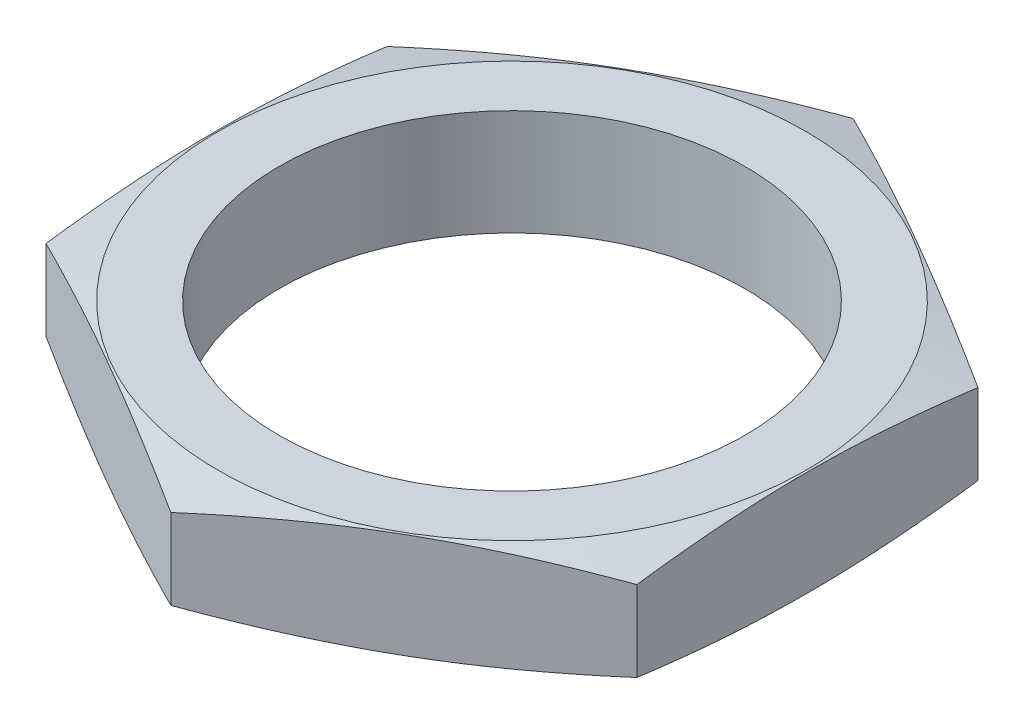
ISO-10303-21;
HEADER;
FILE_DESCRIPTION(('STEP AP214'),'2;1');
FILE_NAME('part.step','',(''),(''),'','','');
FILE_SCHEMA(('AUTOMOTIVE_DESIGN { 1 0 10303 214 1 1 1 1 }'));
ENDSEC;
DATA;
#1=APPLICATION_CONTEXT('core data for automotive mechanical design processes');
#2=APPLICATION_PROTOCOL_DEFINITION('international standard','automotive_design',2000,#1);
#3=PRODUCT_CONTEXT('',#1,'mechanical');
#4=PRODUCT('Part','Part','',(#3));
#5=PRODUCT_RELATED_PRODUCT_CATEGORY('part','',(#4));
#6=PRODUCT_DEFINITION_FORMATION('','',#4);
#7=PRODUCT_DEFINITION_CONTEXT('part definition',#1,'design');
#8=PRODUCT_DEFINITION('design','',#6,#7);
#9=PRODUCT_DEFINITION_SHAPE('','',#8);
#10=(LENGTH_UNIT() NAMED_UNIT(*) SI_UNIT(.MILLI.,.METRE.));
#11=(NAMED_UNIT(*) PLANE_ANGLE_UNIT() SI_UNIT($,.RADIAN.));
#12=(NAMED_UNIT(*) SI_UNIT($,.STERADIAN.) SOLID_ANGLE_UNIT());
#13=UNCERTAINTY_MEASURE_WITH_UNIT(LENGTH_MEASURE(1.E-05),#10,'distance_accuracy_value','');
#14=(GEOMETRIC_REPRESENTATION_CONTEXT(3) GLOBAL_UNCERTAINTY_ASSIGNED_CONTEXT((#13)) GLOBAL_UNIT_ASSIGNED_CONTEXT((#10,
#11,#12)) REPRESENTATION_CONTEXT('',''));
#15=CARTESIAN_POINT('',(0.,0.,0.));
#16=DIRECTION('',(0.,0.,1.));
#17=DIRECTION('',(1.,0.,0.));
#18=AXIS2_PLACEMENT_3D('',#15,#16,#17);
#19=CARTESIAN_POINT('',(-6.975,2.5,-4.02701812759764));
#20=DIRECTION('',(1.,0.,0.));
#21=DIRECTION('',(0.,0.,-1.));
#22=AXIS2_PLACEMENT_3D('',#19,#20,#21);
#23=PLANE('',#22);
#24=CARTESIAN_POINT('',(-6.97499999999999,1.55225197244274,-10.6460668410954));
#25=CARTESIAN_POINT('',(-6.975,1.48136600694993,-10.3297089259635));
#26=CARTESIAN_POINT('',(-6.975,1.41134813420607,-10.0131529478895));
#27=CARTESIAN_POINT('',(-6.975,1.27351713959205,-9.3795476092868));
#28=CARTESIAN_POINT('',(-6.975,1.20570411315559,-9.06249822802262));
#29=CARTESIAN_POINT('',(-6.975,1.0726921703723,-8.42752387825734));
#30=CARTESIAN_POINT('',(-6.975,1.007495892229,-8.10959835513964));
#31=CARTESIAN_POINT('',(-6.975,0.880422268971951,-7.47308507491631));
#32=CARTESIAN_POINT('',(-6.975,0.818544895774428,-7.15449732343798));
#33=CARTESIAN_POINT('',(-6.975,0.69937662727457,-6.51908795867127));
#34=CARTESIAN_POINT('',(-6.975,0.642053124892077,-6.20227249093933));
#35=CARTESIAN_POINT('',(-6.975,0.532418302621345,-5.56777699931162));
#36=CARTESIAN_POINT('',(-6.975,0.480106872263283,-5.25009699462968));
#37=CARTESIAN_POINT('',(-6.975,0.381675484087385,-4.61381156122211));
#38=CARTESIAN_POINT('',(-6.975,0.335554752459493,-4.29520625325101));
#39=CARTESIAN_POINT('',(-6.975,0.250865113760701,-3.65698200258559));
#40=CARTESIAN_POINT('',(-6.975,0.212296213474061,-3.33736305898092));
#41=CARTESIAN_POINT('',(-6.975,0.14380384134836,-2.69350835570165));
#42=CARTESIAN_POINT('',(-6.975,0.113983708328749,-2.36926143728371));
#43=CARTESIAN_POINT('',(-6.975,0.0650469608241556,-1.71995393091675));
#44=CARTESIAN_POINT('',(-6.975,0.0459301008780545,-1.39489336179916));
#45=CARTESIAN_POINT('',(-6.975,0.019514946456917,-0.744429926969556));
#46=CARTESIAN_POINT('',(-6.975,0.0122113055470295,-0.419027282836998));
#47=CARTESIAN_POINT('',(-6.975,0.00987146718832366,0.231822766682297));
#48=CARTESIAN_POINT('',(-6.975,0.0148352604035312,0.557270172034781));
#49=CARTESIAN_POINT('',(-6.975,0.0367511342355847,1.20893749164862));
#50=CARTESIAN_POINT('',(-6.975,0.0537467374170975,1.53515591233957));
#51=CARTESIAN_POINT('',(-6.975,0.0987567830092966,2.18682465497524));
#52=CARTESIAN_POINT('',(-6.975,0.126771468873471,2.51227495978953));
#53=CARTESIAN_POINT('',(-6.975,0.192406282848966,3.16240495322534));
#54=CARTESIAN_POINT('',(-6.975,0.230032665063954,3.48708400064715));
#55=CARTESIAN_POINT('',(-6.975,0.313327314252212,4.13539745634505));
#56=CARTESIAN_POINT('',(-6.975,0.358995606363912,4.45903186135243));
#57=CARTESIAN_POINT('',(-6.975,0.453637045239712,5.08365433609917));
#58=CARTESIAN_POINT('',(-6.975,0.502184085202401,5.38470762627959));
#59=CARTESIAN_POINT('',(-6.975,0.603982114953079,5.98602171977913));
#60=CARTESIAN_POINT('',(-6.975,0.657233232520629,6.28628250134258));
#61=CARTESIAN_POINT('',(-6.975,0.767579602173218,6.88612116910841));
#62=CARTESIAN_POINT('',(-6.975,0.824675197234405,7.18569899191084));
#63=CARTESIAN_POINT('',(-6.975,0.942009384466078,7.78423999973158));
#64=CARTESIAN_POINT('',(-6.975,1.00224801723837,8.08320317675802));
#65=CARTESIAN_POINT('',(-6.975,1.18682528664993,8.979434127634));
#66=CARTESIAN_POINT('',(-6.975,1.3150003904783,9.57591097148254));
#67=CARTESIAN_POINT('',(-6.975,1.57828674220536,10.7672794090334));
#68=CARTESIAN_POINT('',(-6.975,1.7133975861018,11.3621710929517));
#69=CARTESIAN_POINT('',(-6.975,1.98715444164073,12.5449761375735));
#70=CARTESIAN_POINT('',(-6.975,2.12575262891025,13.1329005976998));
#71=CARTESIAN_POINT('',(-6.975,2.40641957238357,14.3079292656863));
#72=CARTESIAN_POINT('',(-6.975,2.54848839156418,14.8950334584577));
#73=CARTESIAN_POINT('',(-6.975,2.8350145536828,16.067892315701));
#74=CARTESIAN_POINT('',(-6.975,2.97946874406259,16.6536477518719));
#75=CARTESIAN_POINT('',(-6.975,3.27035075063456,17.8246482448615));
#76=CARTESIAN_POINT('',(-6.975,3.41677850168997,18.4098933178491));
#77=CARTESIAN_POINT('',(-6.975,3.5639053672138,18.99496044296));
#78=B_SPLINE_CURVE_WITH_KNOTS('',3,(#24,#25,#26,#27,#28,#29,#30,#31,#32,#33,#34,#35,#36,#37,#38,
#39,#40,#41,#42,#43,#44,#45,#46,#47,#48,#49,#50,#51,#52,#53,#54,#55,#56,#57,#58,#59,#60,#61,#62,
#63,#64,#65,#66,#67,#68,#69,#70,#71,#72,#73,#74,#75,#76,#77),.UNSPECIFIED.,.F.,.F.,(4,2,2,2,2,2,
2,2,2,2,2,2,2,2,2,2,2,2,2,2,2,2,2,2,2,2,4),(0.,0.972610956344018,1.94526395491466,
2.91887413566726,3.89247607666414,4.85832291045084,5.8241484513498,6.78985315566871,
7.75555872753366,8.73224987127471,9.70891861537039,10.6851452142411,11.6613710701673,
12.64114638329,13.6209433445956,14.6013794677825,15.5818186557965,16.4966020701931,
17.4114103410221,18.3263003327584,19.2412021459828,21.0714097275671,22.9015108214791,
24.7136166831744,26.5257554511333,28.3356654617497,30.1455158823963),.UNSPECIFIED.);
#79=CARTESIAN_POINT('',(-6.975,0.3,4.02701812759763));
#80=VERTEX_POINT('',#79);
#81=CARTESIAN_POINT('',(-6.975,0.3,-4.02701812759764));
#82=VERTEX_POINT('',#81);
#83=EDGE_CURVE('E50',#80,#82,#78,.F.);
#84=ORIENTED_EDGE('',*,*,#83,.F.);
#85=DIRECTION('',(0.,-1.,0.));
#86=VECTOR('',#85,1.);
#87=CARTESIAN_POINT('',(-6.975,2.5,4.02701812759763));
#88=LINE('',#87,#86);
#89=CARTESIAN_POINT('',(-6.975,2.2,4.02701812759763));
#90=VERTEX_POINT('',#89);
#91=EDGE_CURVE('E11',#90,#80,#88,.T.);
#92=ORIENTED_EDGE('',*,*,#91,.F.);
#93=CARTESIAN_POINT('',(-6.97499999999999,0.947748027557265,-10.6460668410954));
#94=CARTESIAN_POINT('',(-6.975,1.01863399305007,-10.3297089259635));
#95=CARTESIAN_POINT('',(-6.975,1.08865186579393,-10.0131529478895));
#96=CARTESIAN_POINT('',(-6.975,1.22648286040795,-9.3795476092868));
#97=CARTESIAN_POINT('',(-6.975,1.29429588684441,-9.06249822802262));
#98=CARTESIAN_POINT('',(-6.975,1.4273078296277,-8.42752387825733));
#99=CARTESIAN_POINT('',(-6.975,1.492504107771,-8.10959835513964));
#100=CARTESIAN_POINT('',(-6.975,1.61957773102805,-7.47308507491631));
#101=CARTESIAN_POINT('',(-6.975,1.68145510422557,-7.15449732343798));
#102=CARTESIAN_POINT('',(-6.975,1.80062337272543,-6.51908795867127));
#103=CARTESIAN_POINT('',(-6.975,1.85794687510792,-6.20227249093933));
#104=CARTESIAN_POINT('',(-6.975,1.96758169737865,-5.56777699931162));
#105=CARTESIAN_POINT('',(-6.975,2.01989312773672,-5.25009699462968));
#106=CARTESIAN_POINT('',(-6.975,2.11832451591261,-4.61381156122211));
#107=CARTESIAN_POINT('',(-6.975,2.16444524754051,-4.29520625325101));
#108=CARTESIAN_POINT('',(-6.975,2.2491348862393,-3.65698200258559));
#109=CARTESIAN_POINT('',(-6.975,2.28770378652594,-3.33736305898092));
#110=CARTESIAN_POINT('',(-6.975,2.35619615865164,-2.69350835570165));
#111=CARTESIAN_POINT('',(-6.975,2.38601629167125,-2.36926143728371));
#112=CARTESIAN_POINT('',(-6.975,2.43495303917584,-1.71995393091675));
#113=CARTESIAN_POINT('',(-6.975,2.45406989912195,-1.39489336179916));
#114=CARTESIAN_POINT('',(-6.975,2.48048505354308,-0.744429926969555));
#115=CARTESIAN_POINT('',(-6.975,2.48778869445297,-0.419027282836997));
#116=CARTESIAN_POINT('',(-6.975,2.49012853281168,0.231822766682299));
#117=CARTESIAN_POINT('',(-6.975,2.48516473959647,0.557270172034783));
#118=CARTESIAN_POINT('',(-6.975,2.46324886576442,1.20893749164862));
#119=CARTESIAN_POINT('',(-6.975,2.4462532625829,1.53515591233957));
#120=CARTESIAN_POINT('',(-6.975,2.4012432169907,2.18682465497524));
#121=CARTESIAN_POINT('',(-6.975,2.37322853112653,2.51227495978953));
#122=CARTESIAN_POINT('',(-6.975,2.30759371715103,3.16240495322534));
#123=CARTESIAN_POINT('',(-6.975,2.26996733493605,3.48708400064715));
#124=CARTESIAN_POINT('',(-6.975,2.18667268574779,4.13539745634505));
#125=CARTESIAN_POINT('',(-6.975,2.14100439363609,4.45903186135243));
#126=CARTESIAN_POINT('',(-6.975,2.04636295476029,5.08365433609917));
#127=CARTESIAN_POINT('',(-6.975,1.9978159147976,5.38470762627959));
#128=CARTESIAN_POINT('',(-6.975,1.89601788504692,5.98602171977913));
#129=CARTESIAN_POINT('',(-6.975,1.84276676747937,6.28628250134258));
#130=CARTESIAN_POINT('',(-6.975,1.73242039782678,6.88612116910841));
#131=CARTESIAN_POINT('',(-6.975,1.6753248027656,7.18569899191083));
#132=CARTESIAN_POINT('',(-6.975,1.55799061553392,7.78423999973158));
#133=CARTESIAN_POINT('',(-6.975,1.49775198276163,8.08320317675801));
#134=CARTESIAN_POINT('',(-6.975,1.31317471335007,8.979434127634));
#135=CARTESIAN_POINT('',(-6.975,1.1849996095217,9.57591097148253));
#136=CARTESIAN_POINT('',(-6.975,0.921713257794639,10.7672794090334));
#137=CARTESIAN_POINT('',(-6.975,0.786602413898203,11.3621710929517));
#138=CARTESIAN_POINT('',(-6.975,0.512845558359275,12.5449761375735));
#139=CARTESIAN_POINT('',(-6.975,0.37424737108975,13.1329005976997));
#140=CARTESIAN_POINT('',(-6.975,0.0935804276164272,14.3079292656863));
#141=CARTESIAN_POINT('',(-6.975,-0.0484883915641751,14.8950334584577));
#142=CARTESIAN_POINT('',(-6.975,-0.335014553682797,16.067892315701));
#143=CARTESIAN_POINT('',(-6.975,-0.479468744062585,16.6536477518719));
#144=CARTESIAN_POINT('',(-6.975,-0.770350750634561,17.8246482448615));
#145=CARTESIAN_POINT('',(-6.975,-0.916778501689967,18.4098933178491));
#146=CARTESIAN_POINT('',(-6.975,-1.0639053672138,18.99496044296));
#147=B_SPLINE_CURVE_WITH_KNOTS('',3,(#93,#94,#95,#96,#97,#98,#99,#100,#101,#102,#103,#104,#105,
#106,#107,#108,#109,#110,#111,#112,#113,#114,#115,#116,#117,#118,#119,#120,#121,#122,#123,#124,
#125,#126,#127,#128,#129,#130,#131,#132,#133,#134,#135,#136,#137,#138,#139,#140,#141,#142,#143,
#144,#145,#146),.UNSPECIFIED.,.F.,.F.,(4,2,2,2,2,2,2,2,2,2,2,2,2,2,2,2,2,2,2,2,2,2,2,2,2,2,4),
(0.,0.972610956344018,1.94526395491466,2.91887413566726,3.89247607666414,4.85832291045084,
5.8241484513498,6.78985315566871,7.75555872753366,8.73224987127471,9.70891861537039,
10.6851452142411,11.6613710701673,12.64114638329,13.6209433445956,14.6013794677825,
15.5818186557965,16.4966020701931,17.4114103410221,18.3263003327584,19.2412021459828,
21.0714097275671,22.9015108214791,24.7136166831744,26.5257554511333,28.3356654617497,
30.1455158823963),.UNSPECIFIED.);
#148=CARTESIAN_POINT('',(-6.975,2.2,-4.02701812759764));
#149=VERTEX_POINT('',#148);
#150=EDGE_CURVE('E201',#149,#90,#147,.T.);
#151=ORIENTED_EDGE('',*,*,#150,.F.);
#152=DIRECTION('',(0.,-1.,0.));
#153=VECTOR('',#152,1.);
#154=CARTESIAN_POINT('',(-6.975,2.5,-4.02701812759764));
#155=LINE('',#154,#153);
#156=EDGE_CURVE('E107',#149,#82,#155,.T.);
#157=ORIENTED_EDGE('',*,*,#156,.T.);
#158=EDGE_LOOP('',(#84,#92,#151,#157));
#159=FACE_BOUND('',#158,.T.);
#160=ADVANCED_FACE('F35',(#159),#23,.F.);
#161=CARTESIAN_POINT('',(-6.975,2.5,4.02701812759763));
#162=DIRECTION('',(0.500000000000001,0.,-0.866025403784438));
#163=DIRECTION('',(-0.866025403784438,0.,-0.500000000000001));
#164=AXIS2_PLACEMENT_3D('',#161,#162,#163);
#165=PLANE('',#164);
#166=CARTESIAN_POINT('',(0.000199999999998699,0.300030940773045,8.05415172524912));
#167=CARTESIAN_POINT('',(-0.28947080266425,0.255199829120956,7.88691020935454));
#168=CARTESIAN_POINT('',(-0.579666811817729,0.214500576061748,7.71936546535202));
#169=CARTESIAN_POINT('',(-1.16108368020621,0.142995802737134,7.38368427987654));
#170=CARTESIAN_POINT('',(-1.45230490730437,0.11219430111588,7.21554762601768));
#171=CARTESIAN_POINT('',(-2.03400653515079,0.0622832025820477,6.87970203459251));
#172=CARTESIAN_POINT('',(-2.32448300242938,0.0431140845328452,6.71199536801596));
#173=CARTESIAN_POINT('',(-2.90580636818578,0.017410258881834,6.37636816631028));
#174=CARTESIAN_POINT('',(-3.19665318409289,0.0108731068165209,6.20844767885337));
#175=CARTESIAN_POINT('',(-3.77834681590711,0.0108731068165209,5.87260670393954));
#176=CARTESIAN_POINT('',(-4.06919363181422,0.017410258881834,5.70468621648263));
#177=CARTESIAN_POINT('',(-4.65051699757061,0.043114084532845,5.36905901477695));
#178=CARTESIAN_POINT('',(-4.94099346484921,0.0622832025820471,5.2013523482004));
#179=CARTESIAN_POINT('',(-5.52269509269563,0.112194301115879,4.86550675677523));
#180=CARTESIAN_POINT('',(-5.81391631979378,0.142995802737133,4.69737010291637));
#181=CARTESIAN_POINT('',(-6.39533318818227,0.214500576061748,4.36168891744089));
#182=CARTESIAN_POINT('',(-6.68552919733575,0.255199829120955,4.19414417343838));
#183=CARTESIAN_POINT('',(-6.9752,0.300030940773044,4.0269026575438));
#184=B_SPLINE_CURVE_WITH_KNOTS('',3,(#166,#167,#168,#169,#170,#171,#172,#173,#174,#175,#176,
#177,#178,#179,#180,#181,#182,#183),.UNSPECIFIED.,.F.,.F.,(4,2,2,2,2,2,2,2,4),(0.,
1.01247516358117,2.02536089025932,3.03301914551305,4.04048238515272,5.04794562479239,
6.05560388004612,7.06848960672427,8.08096477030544),.UNSPECIFIED.);
#185=CARTESIAN_POINT('',(0.,0.3,8.05403625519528));
#186=VERTEX_POINT('',#185);
#187=EDGE_CURVE('E131',#186,#80,#184,.T.);
#188=ORIENTED_EDGE('',*,*,#187,.F.);
#189=DIRECTION('',(0.,-1.,0.));
#190=VECTOR('',#189,1.);
#191=CARTESIAN_POINT('',(0.,2.5,8.05403625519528));
#192=LINE('',#191,#190);
#193=CARTESIAN_POINT('',(0.,2.2,8.05403625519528));
#194=VERTEX_POINT('',#193);
#195=EDGE_CURVE('E43',#194,#186,#192,.T.);
#196=ORIENTED_EDGE('',*,*,#195,.F.);
#197=CARTESIAN_POINT('',(-6.9752,2.19996905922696,4.0269026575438));
#198=CARTESIAN_POINT('',(-6.68552919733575,2.24480017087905,4.19414417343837));
#199=CARTESIAN_POINT('',(-6.39533318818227,2.28549942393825,4.36168891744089));
#200=CARTESIAN_POINT('',(-5.81391631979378,2.35700419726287,4.69737010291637));
#201=CARTESIAN_POINT('',(-5.52269509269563,2.38780569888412,4.86550675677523));
#202=CARTESIAN_POINT('',(-4.94099346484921,2.43771679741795,5.2013523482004));
#203=CARTESIAN_POINT('',(-4.65051699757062,2.45688591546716,5.36905901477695));
#204=CARTESIAN_POINT('',(-4.06919363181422,2.48258974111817,5.70468621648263));
#205=CARTESIAN_POINT('',(-3.77834681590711,2.48912689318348,5.87260670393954));
#206=CARTESIAN_POINT('',(-3.19665318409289,2.48912689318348,6.20844767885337));
#207=CARTESIAN_POINT('',(-2.90580636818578,2.48258974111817,6.37636816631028));
#208=CARTESIAN_POINT('',(-2.32448300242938,2.45688591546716,6.71199536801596));
#209=CARTESIAN_POINT('',(-2.03400653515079,2.43771679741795,6.87970203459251));
#210=CARTESIAN_POINT('',(-1.45230490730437,2.38780569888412,7.21554762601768));
#211=CARTESIAN_POINT('',(-1.16108368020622,2.35700419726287,7.38368427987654));
#212=CARTESIAN_POINT('',(-0.579666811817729,2.28549942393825,7.71936546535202));
#213=CARTESIAN_POINT('',(-0.28947080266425,2.24480017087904,7.88691020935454));
#214=CARTESIAN_POINT('',(0.000199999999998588,2.19996905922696,8.05415172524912));
#215=B_SPLINE_CURVE_WITH_KNOTS('',3,(#197,#198,#199,#200,#201,#202,#203,#204,#205,#206,#207,
#208,#209,#210,#211,#212,#213,#214),.UNSPECIFIED.,.F.,.F.,(4,2,2,2,2,2,2,2,4),(0.,
1.01247516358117,2.02536089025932,3.03301914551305,4.04048238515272,5.04794562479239,
6.05560388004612,7.06848960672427,8.08096477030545),.UNSPECIFIED.);
#216=EDGE_CURVE('E129',#90,#194,#215,.T.);
#217=ORIENTED_EDGE('',*,*,#216,.F.);
#218=ORIENTED_EDGE('',*,*,#91,.T.);
#219=EDGE_LOOP('',(#188,#196,#217,#218));
#220=FACE_BOUND('',#219,.T.);
#221=ADVANCED_FACE('F128',(#220),#165,.F.);
#222=CARTESIAN_POINT('',(0.,2.5,8.05403625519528));
#223=DIRECTION('',(-0.5,0.,-0.866025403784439));
#224=DIRECTION('',(-0.866025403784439,0.,0.5));
#225=AXIS2_PLACEMENT_3D('',#222,#223,#224);
#226=PLANE('',#225);
#227=CARTESIAN_POINT('',(6.9752,0.300030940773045,4.0269026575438));
#228=CARTESIAN_POINT('',(6.68552919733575,0.255199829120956,4.19414417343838));
#229=CARTESIAN_POINT('',(6.39533318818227,0.214500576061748,4.36168891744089));
#230=CARTESIAN_POINT('',(5.81391631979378,0.142995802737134,4.69737010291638));
#231=CARTESIAN_POINT('',(5.52269509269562,0.11219430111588,4.86550675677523));
#232=CARTESIAN_POINT('',(4.94099346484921,0.0622832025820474,5.20135234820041));
#233=CARTESIAN_POINT('',(4.65051699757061,0.0431140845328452,5.36905901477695));
#234=CARTESIAN_POINT('',(4.06919363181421,0.0174102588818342,5.70468621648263));
#235=CARTESIAN_POINT('',(3.77834681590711,0.0108731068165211,5.87260670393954));
#236=CARTESIAN_POINT('',(3.19665318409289,0.0108731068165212,6.20844767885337));
#237=CARTESIAN_POINT('',(2.90580636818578,0.0174102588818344,6.37636816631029));
#238=CARTESIAN_POINT('',(2.32448300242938,0.0431140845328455,6.71199536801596));
#239=CARTESIAN_POINT('',(2.03400653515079,0.0622832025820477,6.87970203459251));
#240=CARTESIAN_POINT('',(1.45230490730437,0.11219430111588,7.21554762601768));
#241=CARTESIAN_POINT('',(1.16108368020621,0.142995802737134,7.38368427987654));
#242=CARTESIAN_POINT('',(0.579666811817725,0.214500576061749,7.71936546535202));
#243=CARTESIAN_POINT('',(0.289470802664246,0.255199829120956,7.88691020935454));
#244=CARTESIAN_POINT('',(-0.00020000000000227,0.300030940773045,8.05415172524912));
#245=B_SPLINE_CURVE_WITH_KNOTS('',3,(#227,#228,#229,#230,#231,#232,#233,#234,#235,#236,#237,
#238,#239,#240,#241,#242,#243,#244),.UNSPECIFIED.,.F.,.F.,(4,2,2,2,2,2,2,2,4),(0.,
1.01247516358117,2.02536089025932,3.03301914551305,4.04048238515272,5.04794562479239,
6.05560388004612,7.06848960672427,8.08096477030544),.UNSPECIFIED.);
#246=CARTESIAN_POINT('',(6.975,0.3,4.02701812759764));
#247=VERTEX_POINT('',#246);
#248=EDGE_CURVE('E123',#247,#186,#245,.T.);
#249=ORIENTED_EDGE('',*,*,#248,.F.);
#250=DIRECTION('',(0.,-1.,0.));
#251=VECTOR('',#250,1.);
#252=CARTESIAN_POINT('',(6.975,2.5,4.02701812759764));
#253=LINE('',#252,#251);
#254=CARTESIAN_POINT('',(6.975,2.2,4.02701812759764));
#255=VERTEX_POINT('',#254);
#256=EDGE_CURVE('E109',#255,#247,#253,.T.);
#257=ORIENTED_EDGE('',*,*,#256,.F.);
#258=CARTESIAN_POINT('',(-0.000200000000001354,2.19996905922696,8.05415172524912));
#259=CARTESIAN_POINT('',(0.289470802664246,2.24480017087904,7.88691020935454));
#260=CARTESIAN_POINT('',(0.579666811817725,2.28549942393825,7.71936546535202));
#261=CARTESIAN_POINT('',(1.16108368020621,2.35700419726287,7.38368427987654));
#262=CARTESIAN_POINT('',(1.45230490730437,2.38780569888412,7.21554762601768));
#263=CARTESIAN_POINT('',(2.03400653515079,2.43771679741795,6.87970203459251));
#264=CARTESIAN_POINT('',(2.32448300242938,2.45688591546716,6.71199536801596));
#265=CARTESIAN_POINT('',(2.90580636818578,2.48258974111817,6.37636816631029));
#266=CARTESIAN_POINT('',(3.19665318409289,2.48912689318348,6.20844767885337));
#267=CARTESIAN_POINT('',(3.77834681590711,2.48912689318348,5.87260670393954));
#268=CARTESIAN_POINT('',(4.06919363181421,2.48258974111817,5.70468621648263));
#269=CARTESIAN_POINT('',(4.65051699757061,2.45688591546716,5.36905901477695));
#270=CARTESIAN_POINT('',(4.94099346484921,2.43771679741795,5.20135234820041));
#271=CARTESIAN_POINT('',(5.52269509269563,2.38780569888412,4.86550675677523));
#272=CARTESIAN_POINT('',(5.81391631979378,2.35700419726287,4.69737010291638));
#273=CARTESIAN_POINT('',(6.39533318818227,2.28549942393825,4.36168891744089));
#274=CARTESIAN_POINT('',(6.68552919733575,2.24480017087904,4.19414417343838));
#275=CARTESIAN_POINT('',(6.9752,2.19996905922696,4.0269026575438));
#276=B_SPLINE_CURVE_WITH_KNOTS('',3,(#258,#259,#260,#261,#262,#263,#264,#265,#266,#267,#268,
#269,#270,#271,#272,#273,#274,#275),.UNSPECIFIED.,.F.,.F.,(4,2,2,2,2,2,2,2,4),(0.,
1.01247516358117,2.02536089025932,3.03301914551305,4.04048238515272,5.04794562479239,
6.05560388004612,7.06848960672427,8.08096477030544),.UNSPECIFIED.);
#277=EDGE_CURVE('E124',#194,#255,#276,.T.);
#278=ORIENTED_EDGE('',*,*,#277,.F.);
#279=ORIENTED_EDGE('',*,*,#195,.T.);
#280=EDGE_LOOP('',(#249,#257,#278,#279));
#281=FACE_BOUND('',#280,.T.);
#282=ADVANCED_FACE('F121',(#281),#226,.F.);
#283=CARTESIAN_POINT('',(6.975,2.5,4.02701812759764));
#284=DIRECTION('',(-1.,0.,0.));
#285=DIRECTION('',(0.,0.,1.));
#286=AXIS2_PLACEMENT_3D('',#283,#284,#285);
#287=PLANE('',#286);
#288=CARTESIAN_POINT('',(6.975,1.5522522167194,-10.6460679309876));
#289=CARTESIAN_POINT('',(6.975,1.48136623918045,-10.3297099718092));
#290=CARTESIAN_POINT('',(6.975,1.41134835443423,-10.0131539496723));
#291=CARTESIAN_POINT('',(6.975,1.27351733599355,-9.37954852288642));
#292=CARTESIAN_POINT('',(6.975,1.20570429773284,-9.06249909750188));
#293=CARTESIAN_POINT('',(6.975,1.07269233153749,-8.42752465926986));
#294=CARTESIAN_POINT('',(6.975,1.00749604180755,-8.10959909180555));
#295=CARTESIAN_POINT('',(6.975,0.880422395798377,-7.47308572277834));
#296=CARTESIAN_POINT('',(6.975,0.81854501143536,-7.15449792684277));
#297=CARTESIAN_POINT('',(6.975,0.699376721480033,-6.51908847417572));
#298=CARTESIAN_POINT('',(6.975,0.642053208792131,-6.20227296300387));
#299=CARTESIAN_POINT('',(6.975,0.532418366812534,-5.56777738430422));
#300=CARTESIAN_POINT('',(6.975,0.480106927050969,-5.25009733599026));
#301=CARTESIAN_POINT('',(6.975,0.381675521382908,-4.61381181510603));
#302=CARTESIAN_POINT('',(6.975,0.335554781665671,-4.29520646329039));
#303=CARTESIAN_POINT('',(6.975,0.250865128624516,-3.65698212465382));
#304=CARTESIAN_POINT('',(6.975,0.212296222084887,-3.33736313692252));
#305=CARTESIAN_POINT('',(6.975,0.143803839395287,-2.69350834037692));
#306=CARTESIAN_POINT('',(6.975,0.113983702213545,-2.36926137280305));
#307=CARTESIAN_POINT('',(6.975,0.065046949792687,-1.71995376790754));
#308=CARTESIAN_POINT('',(6.975,0.0459300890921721,-1.39489314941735));
#309=CARTESIAN_POINT('',(6.975,0.019514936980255,-0.744429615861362));
#310=CARTESIAN_POINT('',(6.975,0.0122112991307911,-0.419026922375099));
#311=CARTESIAN_POINT('',(6.975,0.00987147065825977,0.231823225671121));
#312=CARTESIAN_POINT('',(6.975,0.0148352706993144,0.557270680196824));
#313=CARTESIAN_POINT('',(6.975,0.0367511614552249,1.20893809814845));
#314=CARTESIAN_POINT('',(6.975,0.053746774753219,1.5351565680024));
#315=CARTESIAN_POINT('',(6.975,0.0987568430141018,2.18682540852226));
#316=CARTESIAN_POINT('',(6.975,0.12677154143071,2.51227576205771));
#317=CARTESIAN_POINT('',(6.975,0.192406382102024,3.16240585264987));
#318=CARTESIAN_POINT('',(6.975,0.230032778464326,3.48708494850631));
#319=CARTESIAN_POINT('',(6.975,0.31332745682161,4.13539850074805));
#320=CARTESIAN_POINT('',(6.975,0.358995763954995,4.45903295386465));
#321=CARTESIAN_POINT('',(6.975,0.453637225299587,5.08365547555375));
#322=CARTESIAN_POINT('',(6.975,0.502184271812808,5.3847087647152));
#323=CARTESIAN_POINT('',(6.975,0.603982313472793,5.98602285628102));
#324=CARTESIAN_POINT('',(6.975,0.657233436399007,6.28628363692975));
#325=CARTESIAN_POINT('',(6.975,0.767579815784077,6.88612230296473));
#326=CARTESIAN_POINT('',(6.975,0.824675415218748,7.1857001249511));
#327=CARTESIAN_POINT('',(6.975,0.942009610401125,7.78424113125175));
#328=CARTESIAN_POINT('',(6.975,1.0022482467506,8.08320430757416));
#329=CARTESIAN_POINT('',(6.975,1.18682552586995,8.97943525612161));
#330=CARTESIAN_POINT('',(6.975,1.31500063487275,9.57591209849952));
#331=CARTESIAN_POINT('',(6.975,1.57828699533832,10.7672805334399));
#332=CARTESIAN_POINT('',(6.975,1.71339784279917,11.3621722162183));
#333=CARTESIAN_POINT('',(6.975,1.98715470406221,12.5449772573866));
#334=CARTESIAN_POINT('',(6.975,2.12575289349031,13.1329017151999));
#335=CARTESIAN_POINT('',(6.975,2.4064198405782,14.3079303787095));
#336=CARTESIAN_POINT('',(6.975,2.54848866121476,14.8950345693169));
#337=CARTESIAN_POINT('',(6.975,2.83501482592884,16.0678934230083));
#338=CARTESIAN_POINT('',(6.975,2.97946901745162,16.6536488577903));
#339=CARTESIAN_POINT('',(6.975,3.27035102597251,17.8246493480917));
#340=CARTESIAN_POINT('',(6.975,3.41677877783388,18.4098944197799));
#341=CARTESIAN_POINT('',(6.975,3.56390564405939,18.9949615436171));
#342=B_SPLINE_CURVE_WITH_KNOTS('',3,(#288,#289,#290,#291,#292,#293,#294,#295,#296,#297,#298,
#299,#300,#301,#302,#303,#304,#305,#306,#307,#308,#309,#310,#311,#312,#313,#314,#315,#316,#317,
#318,#319,#320,#321,#322,#323,#324,#325,#326,#327,#328,#329,#330,#331,#332,#333,#334,#335,#336,
#337,#338,#339,#340,#341),.UNSPECIFIED.,.F.,.F.,(4,2,2,2,2,2,2,2,2,2,2,2,2,2,2,2,2,2,2,2,2,2,2,
2,2,2,4),(0.,0.972611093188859,1.94526422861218,2.91887454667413,3.89247662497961,
4.85832359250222,5.82414926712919,6.78985410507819,7.75555981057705,8.73225110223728,
9.70891999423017,10.6851467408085,11.66137274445,12.6411482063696,13.620945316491,
14.6013815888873,15.5818209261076,16.4966043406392,17.4114126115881,18.3263026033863,
19.2412044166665,21.071411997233,22.901513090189,24.7136189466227,26.5257577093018,
28.3356677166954,30.1455181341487),.UNSPECIFIED.);
#343=CARTESIAN_POINT('',(6.975,0.3,-4.02701812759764));
#344=VERTEX_POINT('',#343);
#345=EDGE_CURVE('E103',#344,#247,#342,.T.);
#346=ORIENTED_EDGE('',*,*,#345,.F.);
#347=DIRECTION('',(0.,-1.,0.));
#348=VECTOR('',#347,1.);
#349=CARTESIAN_POINT('',(6.975,2.5,-4.02701812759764));
#350=LINE('',#349,#348);
#351=CARTESIAN_POINT('',(6.975,2.2,-4.02701812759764));
#352=VERTEX_POINT('',#351);
#353=EDGE_CURVE('E102',#352,#344,#350,.T.);
#354=ORIENTED_EDGE('',*,*,#353,.F.);
#355=CARTESIAN_POINT('',(6.975,0.947747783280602,-10.6460679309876));
#356=CARTESIAN_POINT('',(6.975,1.01863376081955,-10.3297099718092));
#357=CARTESIAN_POINT('',(6.975,1.08865164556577,-10.0131539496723));
#358=CARTESIAN_POINT('',(6.975,1.22648266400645,-9.37954852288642));
#359=CARTESIAN_POINT('',(6.975,1.29429570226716,-9.06249909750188));
#360=CARTESIAN_POINT('',(6.975,1.42730766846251,-8.42752465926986));
#361=CARTESIAN_POINT('',(6.975,1.49250395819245,-8.10959909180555));
#362=CARTESIAN_POINT('',(6.975,1.61957760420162,-7.47308572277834));
#363=CARTESIAN_POINT('',(6.975,1.68145498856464,-7.15449792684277));
#364=CARTESIAN_POINT('',(6.975,1.80062327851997,-6.51908847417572));
#365=CARTESIAN_POINT('',(6.975,1.85794679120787,-6.20227296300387));
#366=CARTESIAN_POINT('',(6.975,1.96758163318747,-5.56777738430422));
#367=CARTESIAN_POINT('',(6.975,2.01989307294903,-5.25009733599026));
#368=CARTESIAN_POINT('',(6.975,2.11832447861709,-4.61381181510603));
#369=CARTESIAN_POINT('',(6.975,2.16444521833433,-4.29520646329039));
#370=CARTESIAN_POINT('',(6.975,2.24913487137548,-3.65698212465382));
#371=CARTESIAN_POINT('',(6.975,2.28770377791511,-3.33736313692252));
#372=CARTESIAN_POINT('',(6.975,2.35619616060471,-2.69350834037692));
#373=CARTESIAN_POINT('',(6.975,2.38601629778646,-2.36926137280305));
#374=CARTESIAN_POINT('',(6.975,2.43495305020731,-1.71995376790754));
#375=CARTESIAN_POINT('',(6.975,2.45406991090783,-1.39489314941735));
#376=CARTESIAN_POINT('',(6.975,2.48048506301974,-0.744429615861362));
#377=CARTESIAN_POINT('',(6.975,2.48778870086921,-0.419026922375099));
#378=CARTESIAN_POINT('',(6.975,2.49012852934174,0.231823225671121));
#379=CARTESIAN_POINT('',(6.975,2.48516472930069,0.557270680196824));
#380=CARTESIAN_POINT('',(6.975,2.46324883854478,1.20893809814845));
#381=CARTESIAN_POINT('',(6.975,2.44625322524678,1.5351565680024));
#382=CARTESIAN_POINT('',(6.975,2.4012431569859,2.18682540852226));
#383=CARTESIAN_POINT('',(6.975,2.37322845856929,2.51227576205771));
#384=CARTESIAN_POINT('',(6.975,2.30759361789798,3.16240585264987));
#385=CARTESIAN_POINT('',(6.975,2.26996722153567,3.48708494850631));
#386=CARTESIAN_POINT('',(6.975,2.18667254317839,4.13539850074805));
#387=CARTESIAN_POINT('',(6.975,2.14100423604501,4.45903295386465));
#388=CARTESIAN_POINT('',(6.975,2.04636277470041,5.08365547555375));
#389=CARTESIAN_POINT('',(6.975,1.99781572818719,5.3847087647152));
#390=CARTESIAN_POINT('',(6.975,1.89601768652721,5.98602285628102));
#391=CARTESIAN_POINT('',(6.975,1.84276656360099,6.28628363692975));
#392=CARTESIAN_POINT('',(6.975,1.73242018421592,6.88612230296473));
#393=CARTESIAN_POINT('',(6.975,1.67532458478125,7.1857001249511));
#394=CARTESIAN_POINT('',(6.975,1.55799038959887,7.78424113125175));
#395=CARTESIAN_POINT('',(6.975,1.4977517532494,8.08320430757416));
#396=CARTESIAN_POINT('',(6.975,1.31317447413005,8.97943525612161));
#397=CARTESIAN_POINT('',(6.975,1.18499936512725,9.57591209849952));
#398=CARTESIAN_POINT('',(6.975,0.921713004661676,10.7672805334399));
#399=CARTESIAN_POINT('',(6.975,0.786602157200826,11.3621722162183));
#400=CARTESIAN_POINT('',(6.975,0.512845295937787,12.5449772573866));
#401=CARTESIAN_POINT('',(6.975,0.374247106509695,13.1329017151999));
#402=CARTESIAN_POINT('',(6.975,0.0935801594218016,14.3079303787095));
#403=CARTESIAN_POINT('',(6.975,-0.0484886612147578,14.8950345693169));
#404=CARTESIAN_POINT('',(6.975,-0.335014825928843,16.0678934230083));
#405=CARTESIAN_POINT('',(6.975,-0.479469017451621,16.6536488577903));
#406=CARTESIAN_POINT('',(6.975,-0.77035102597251,17.8246493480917));
#407=CARTESIAN_POINT('',(6.975,-0.91677877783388,18.4098944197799));
#408=CARTESIAN_POINT('',(6.975,-1.06390564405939,18.9949615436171));
#409=B_SPLINE_CURVE_WITH_KNOTS('',3,(#355,#356,#357,#358,#359,#360,#361,#362,#363,#364,#365,
#366,#367,#368,#369,#370,#371,#372,#373,#374,#375,#376,#377,#378,#379,#380,#381,#382,#383,#384,
#385,#386,#387,#388,#389,#390,#391,#392,#393,#394,#395,#396,#397,#398,#399,#400,#401,#402,#403,
#404,#405,#406,#407,#408),.UNSPECIFIED.,.F.,.F.,(4,2,2,2,2,2,2,2,2,2,2,2,2,2,2,2,2,2,2,2,2,2,2,
2,2,2,4),(0.,0.972611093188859,1.94526422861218,2.91887454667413,3.89247662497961,
4.85832359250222,5.82414926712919,6.78985410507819,7.75555981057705,8.73225110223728,
9.70891999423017,10.6851467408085,11.66137274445,12.6411482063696,13.620945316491,
14.6013815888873,15.5818209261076,16.4966043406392,17.4114126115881,18.3263026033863,
19.2412044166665,21.071411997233,22.901513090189,24.7136189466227,26.5257577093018,
28.3356677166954,30.1455181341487),.UNSPECIFIED.);
#410=EDGE_CURVE('E183',#255,#352,#409,.F.);
#411=ORIENTED_EDGE('',*,*,#410,.F.);
#412=ORIENTED_EDGE('',*,*,#256,.T.);
#413=EDGE_LOOP('',(#346,#354,#411,#412));
#414=FACE_BOUND('',#413,.T.);
#415=ADVANCED_FACE('F175',(#414),#287,.F.);
#416=CARTESIAN_POINT('',(6.975,2.5,-4.02701812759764));
#417=DIRECTION('',(-0.500000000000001,0.,0.866025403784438));
#418=DIRECTION('',(0.866025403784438,0.,0.500000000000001));
#419=AXIS2_PLACEMENT_3D('',#416,#417,#418);
#420=PLANE('',#419);
#421=CARTESIAN_POINT('',(-0.00019999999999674,0.300030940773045,-8.05415172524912));
#422=CARTESIAN_POINT('',(0.289470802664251,0.255199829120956,-7.88691020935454));
#423=CARTESIAN_POINT('',(0.57966681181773,0.214500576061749,-7.71936546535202));
#424=CARTESIAN_POINT('',(1.16108368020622,0.142995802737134,-7.38368427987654));
#425=CARTESIAN_POINT('',(1.45230490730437,0.112194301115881,-7.21554762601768));
#426=CARTESIAN_POINT('',(2.03400653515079,0.0622832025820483,-6.87970203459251));
#427=CARTESIAN_POINT('',(2.32448300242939,0.0431140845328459,-6.71199536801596));
#428=CARTESIAN_POINT('',(2.90580636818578,0.0174102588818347,-6.37636816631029));
#429=CARTESIAN_POINT('',(3.19665318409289,0.0108731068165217,-6.20844767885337));
#430=CARTESIAN_POINT('',(3.77834681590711,0.0108731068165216,-5.87260670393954));
#431=CARTESIAN_POINT('',(4.06919363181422,0.0174102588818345,-5.70468621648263));
#432=CARTESIAN_POINT('',(4.65051699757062,0.0431140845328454,-5.36905901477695));
#433=CARTESIAN_POINT('',(4.94099346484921,0.0622832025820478,-5.2013523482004));
#434=CARTESIAN_POINT('',(5.52269509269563,0.11219430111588,-4.86550675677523));
#435=CARTESIAN_POINT('',(5.81391631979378,0.142995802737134,-4.69737010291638));
#436=CARTESIAN_POINT('',(6.39533318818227,0.214500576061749,-4.36168891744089));
#437=CARTESIAN_POINT('',(6.68552919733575,0.255199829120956,-4.19414417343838));
#438=CARTESIAN_POINT('',(6.9752,0.300030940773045,-4.0269026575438));
#439=B_SPLINE_CURVE_WITH_KNOTS('',3,(#421,#422,#423,#424,#425,#426,#427,#428,#429,#430,#431,
#432,#433,#434,#435,#436,#437,#438),.UNSPECIFIED.,.F.,.F.,(4,2,2,2,2,2,2,2,4),(0.,
1.01247516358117,2.02536089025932,3.03301914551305,4.04048238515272,5.04794562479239,
6.05560388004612,7.06848960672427,8.08096477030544),.UNSPECIFIED.);
#440=CARTESIAN_POINT('',(0.,0.3,-8.05403625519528));
#441=VERTEX_POINT('',#440);
#442=EDGE_CURVE('E88',#441,#344,#439,.T.);
#443=ORIENTED_EDGE('',*,*,#442,.F.);
#444=DIRECTION('',(0.,-1.,0.));
#445=VECTOR('',#444,1.);
#446=CARTESIAN_POINT('',(0.,2.5,-8.05403625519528));
#447=LINE('',#446,#445);
#448=CARTESIAN_POINT('',(0.,2.2,-8.05403625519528));
#449=VERTEX_POINT('',#448);
#450=EDGE_CURVE('E100',#449,#441,#447,.T.);
#451=ORIENTED_EDGE('',*,*,#450,.F.);
#452=CARTESIAN_POINT('',(6.9752,2.19996905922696,-4.0269026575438));
#453=CARTESIAN_POINT('',(6.68552919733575,2.24480017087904,-4.19414417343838));
#454=CARTESIAN_POINT('',(6.39533318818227,2.28549942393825,-4.36168891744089));
#455=CARTESIAN_POINT('',(5.81391631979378,2.35700419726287,-4.69737010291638));
#456=CARTESIAN_POINT('',(5.52269509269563,2.38780569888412,-4.86550675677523));
#457=CARTESIAN_POINT('',(4.94099346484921,2.43771679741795,-5.2013523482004));
#458=CARTESIAN_POINT('',(4.65051699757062,2.45688591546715,-5.36905901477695));
#459=CARTESIAN_POINT('',(4.06919363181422,2.48258974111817,-5.70468621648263));
#460=CARTESIAN_POINT('',(3.77834681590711,2.48912689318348,-5.87260670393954));
#461=CARTESIAN_POINT('',(3.19665318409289,2.48912689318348,-6.20844767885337));
#462=CARTESIAN_POINT('',(2.90580636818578,2.48258974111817,-6.37636816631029));
#463=CARTESIAN_POINT('',(2.32448300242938,2.45688591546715,-6.71199536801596));
#464=CARTESIAN_POINT('',(2.03400653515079,2.43771679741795,-6.87970203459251));
#465=CARTESIAN_POINT('',(1.45230490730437,2.38780569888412,-7.21554762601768));
#466=CARTESIAN_POINT('',(1.16108368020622,2.35700419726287,-7.38368427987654));
#467=CARTESIAN_POINT('',(0.57966681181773,2.28549942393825,-7.71936546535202));
#468=CARTESIAN_POINT('',(0.289470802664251,2.24480017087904,-7.88691020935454));
#469=CARTESIAN_POINT('',(-0.000199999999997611,2.19996905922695,-8.05415172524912));
#470=B_SPLINE_CURVE_WITH_KNOTS('',3,(#452,#453,#454,#455,#456,#457,#458,#459,#460,#461,#462,
#463,#464,#465,#466,#467,#468,#469),.UNSPECIFIED.,.F.,.F.,(4,2,2,2,2,2,2,2,4),(0.,
1.01247516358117,2.02536089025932,3.03301914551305,4.04048238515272,5.04794562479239,
6.05560388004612,7.06848960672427,8.08096477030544),.UNSPECIFIED.);
#471=EDGE_CURVE('E58',#352,#449,#470,.T.);
#472=ORIENTED_EDGE('',*,*,#471,.F.);
#473=ORIENTED_EDGE('',*,*,#353,.T.);
#474=EDGE_LOOP('',(#443,#451,#472,#473));
#475=FACE_BOUND('',#474,.T.);
#476=ADVANCED_FACE('F99',(#475),#420,.F.);
#477=CARTESIAN_POINT('',(0.,2.5,-8.05403625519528));
#478=DIRECTION('',(0.5,0.,0.866025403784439));
#479=DIRECTION('',(0.866025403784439,0.,-0.5));
#480=AXIS2_PLACEMENT_3D('',#477,#478,#479);
#481=PLANE('',#480);
#482=CARTESIAN_POINT('',(-6.9752,0.300030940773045,-4.02690265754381));
#483=CARTESIAN_POINT('',(-6.68552919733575,0.255199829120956,-4.19414417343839));
#484=CARTESIAN_POINT('',(-6.39533318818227,0.214500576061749,-4.3616889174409));
#485=CARTESIAN_POINT('',(-5.81391631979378,0.142995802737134,-4.69737010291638));
#486=CARTESIAN_POINT('',(-5.52269509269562,0.112194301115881,-4.86550675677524));
#487=CARTESIAN_POINT('',(-4.9409934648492,0.0622832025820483,-5.20135234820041));
#488=CARTESIAN_POINT('',(-4.65051699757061,0.0431140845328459,-5.36905901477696));
#489=CARTESIAN_POINT('',(-4.06919363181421,0.0174102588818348,-5.70468621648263));
#490=CARTESIAN_POINT('',(-3.7783468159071,0.0108731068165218,-5.87260670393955));
#491=CARTESIAN_POINT('',(-3.19665318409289,0.0108731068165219,-6.20844767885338));
#492=CARTESIAN_POINT('',(-2.90580636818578,0.017410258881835,-6.37636816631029));
#493=CARTESIAN_POINT('',(-2.32448300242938,0.0431140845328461,-6.71199536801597));
#494=CARTESIAN_POINT('',(-2.03400653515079,0.0622832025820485,-6.87970203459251));
#495=CARTESIAN_POINT('',(-1.45230490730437,0.112194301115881,-7.21554762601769));
#496=CARTESIAN_POINT('',(-1.16108368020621,0.142995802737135,-7.38368427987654));
#497=CARTESIAN_POINT('',(-0.579666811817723,0.214500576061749,-7.71936546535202));
#498=CARTESIAN_POINT('',(-0.289470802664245,0.255199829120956,-7.88691020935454));
#499=CARTESIAN_POINT('',(0.000200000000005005,0.300030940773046,-8.05415172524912));
#500=B_SPLINE_CURVE_WITH_KNOTS('',3,(#482,#483,#484,#485,#486,#487,#488,#489,#490,#491,#492,
#493,#494,#495,#496,#497,#498,#499),.UNSPECIFIED.,.F.,.F.,(4,2,2,2,2,2,2,2,4),(0.,
1.01247516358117,2.02536089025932,3.03301914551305,4.04048238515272,5.04794562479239,
6.05560388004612,7.06848960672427,8.08096477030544),.UNSPECIFIED.);
#501=EDGE_CURVE('E85',#82,#441,#500,.T.);
#502=ORIENTED_EDGE('',*,*,#501,.F.);
#503=ORIENTED_EDGE('',*,*,#156,.F.);
#504=CARTESIAN_POINT('',(0.000200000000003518,2.19996905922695,-8.05415172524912));
#505=CARTESIAN_POINT('',(-0.289470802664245,2.24480017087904,-7.88691020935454));
#506=CARTESIAN_POINT('',(-0.579666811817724,2.28549942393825,-7.71936546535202));
#507=CARTESIAN_POINT('',(-1.16108368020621,2.35700419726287,-7.38368427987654));
#508=CARTESIAN_POINT('',(-1.45230490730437,2.38780569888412,-7.21554762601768));
#509=CARTESIAN_POINT('',(-2.03400653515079,2.43771679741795,-6.87970203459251));
#510=CARTESIAN_POINT('',(-2.32448300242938,2.45688591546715,-6.71199536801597));
#511=CARTESIAN_POINT('',(-2.90580636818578,2.48258974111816,-6.37636816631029));
#512=CARTESIAN_POINT('',(-3.19665318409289,2.48912689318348,-6.20844767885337));
#513=CARTESIAN_POINT('',(-3.7783468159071,2.48912689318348,-5.87260670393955));
#514=CARTESIAN_POINT('',(-4.06919363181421,2.48258974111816,-5.70468621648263));
#515=CARTESIAN_POINT('',(-4.65051699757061,2.45688591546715,-5.36905901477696));
#516=CARTESIAN_POINT('',(-4.94099346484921,2.43771679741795,-5.20135234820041));
#517=CARTESIAN_POINT('',(-5.52269509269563,2.38780569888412,-4.86550675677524));
#518=CARTESIAN_POINT('',(-5.81391631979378,2.35700419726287,-4.69737010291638));
#519=CARTESIAN_POINT('',(-6.39533318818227,2.28549942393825,-4.3616889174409));
#520=CARTESIAN_POINT('',(-6.68552919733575,2.24480017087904,-4.19414417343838));
#521=CARTESIAN_POINT('',(-6.9752,2.19996905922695,-4.0269026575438));
#522=B_SPLINE_CURVE_WITH_KNOTS('',3,(#504,#505,#506,#507,#508,#509,#510,#511,#512,#513,#514,
#515,#516,#517,#518,#519,#520,#521),.UNSPECIFIED.,.F.,.F.,(4,2,2,2,2,2,2,2,4),(0.,
1.01247516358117,2.02536089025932,3.03301914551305,4.04048238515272,5.04794562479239,
6.05560388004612,7.06848960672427,8.08096477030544),.UNSPECIFIED.);
#523=EDGE_CURVE('E106',#449,#149,#522,.T.);
#524=ORIENTED_EDGE('',*,*,#523,.F.);
#525=ORIENTED_EDGE('',*,*,#450,.T.);
#526=EDGE_LOOP('',(#502,#503,#524,#525));
#527=FACE_BOUND('',#526,.T.);
#528=ADVANCED_FACE('F105',(#527),#481,.F.);
#529=CARTESIAN_POINT('',(0.,0.,0.));
#530=DIRECTION('',(0.,1.,0.));
#531=DIRECTION('',(0.,0.,1.));
#532=AXIS2_PLACEMENT_3D('',#529,#530,#531);
#533=PLANE('',#532);
#534=CARTESIAN_POINT('',(0.,0.,0.));
#535=DIRECTION('',(0.,1.,0.));
#536=DIRECTION('',(0.,0.,1.));
#537=AXIS2_PLACEMENT_3D('',#534,#535,#536);
#538=CIRCLE('',#537,5.5);
#539=CARTESIAN_POINT('',(0.,0.,5.5));
#540=VERTEX_POINT('',#539);
#541=EDGE_CURVE('E111',#540,#540,#538,.T.);
#542=ORIENTED_EDGE('',*,*,#541,.T.);
#543=EDGE_LOOP('',(#542));
#544=FACE_BOUND('',#543,.T.);
#545=CARTESIAN_POINT('',(0.,0.,0.));
#546=DIRECTION('',(0.,-1.,0.));
#547=DIRECTION('',(0.,0.,-1.));
#548=AXIS2_PLACEMENT_3D('',#545,#546,#547);
#549=CIRCLE('',#548,6.93442101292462);
#550=CARTESIAN_POINT('',(0.,0.,-6.93442101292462));
#551=VERTEX_POINT('',#550);
#552=EDGE_CURVE('E94',#551,#551,#549,.T.);
#553=ORIENTED_EDGE('',*,*,#552,.T.);
#554=EDGE_LOOP('',(#553));
#555=FACE_BOUND('',#554,.T.);
#556=ADVANCED_FACE('F211',(#544,#555),#533,.F.);
#557=CARTESIAN_POINT('',(0.,2.5,0.));
#558=DIRECTION('',(0.,1.,0.));
#559=DIRECTION('',(0.,0.,1.));
#560=AXIS2_PLACEMENT_3D('',#557,#558,#559);
#561=PLANE('',#560);
#562=CARTESIAN_POINT('',(0.,2.5,0.));
#563=DIRECTION('',(0.,1.,0.));
#564=DIRECTION('',(0.,0.,1.));
#565=AXIS2_PLACEMENT_3D('',#562,#563,#564);
#566=CIRCLE('',#565,5.5);
#567=CARTESIAN_POINT('',(0.,2.5,5.5));
#568=VERTEX_POINT('',#567);
#569=EDGE_CURVE('E206',#568,#568,#566,.T.);
#570=ORIENTED_EDGE('',*,*,#569,.F.);
#571=EDGE_LOOP('',(#570));
#572=FACE_BOUND('',#571,.T.);
#573=CARTESIAN_POINT('',(0.,2.5,0.));
#574=DIRECTION('',(0.,-1.,0.));
#575=DIRECTION('',(0.,0.,-1.));
#576=AXIS2_PLACEMENT_3D('',#573,#574,#575);
#577=CIRCLE('',#576,6.93442101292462);
#578=CARTESIAN_POINT('',(0.,2.5,-6.93442101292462));
#579=VERTEX_POINT('',#578);
#580=EDGE_CURVE('E133',#579,#579,#577,.T.);
#581=ORIENTED_EDGE('',*,*,#580,.F.);
#582=EDGE_LOOP('',(#581));
#583=FACE_BOUND('',#582,.T.);
#584=ADVANCED_FACE('F217',(#572,#583),#561,.T.);
#585=CARTESIAN_POINT('',(0.,2.5,0.));
#586=DIRECTION('',(0.,1.,0.));
#587=DIRECTION('',(0.,0.,1.));
#588=AXIS2_PLACEMENT_3D('',#585,#586,#587);
#589=CYLINDRICAL_SURFACE('',#588,5.5);
#590=ORIENTED_EDGE('',*,*,#541,.F.);
#591=EDGE_LOOP('',(#590));
#592=FACE_BOUND('',#591,.T.);
#593=ORIENTED_EDGE('',*,*,#569,.T.);
#594=EDGE_LOOP('',(#593));
#595=FACE_BOUND('',#594,.T.);
#596=ADVANCED_FACE('F214',(#592,#595),#589,.F.);
#597=CARTESIAN_POINT('',(0.,2.2,0.));
#598=DIRECTION('',(0.,-1.,0.));
#599=DIRECTION('',(0.,0.,-1.));
#600=AXIS2_PLACEMENT_3D('',#597,#598,#599);
#601=CONICAL_SURFACE('',#600,8.05403625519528,1.30899693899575);
#602=ORIENTED_EDGE('',*,*,#580,.T.);
#603=EDGE_LOOP('',(#602));
#604=FACE_BOUND('',#603,.T.);
#605=ORIENTED_EDGE('',*,*,#150,.T.);
#606=ORIENTED_EDGE('',*,*,#216,.T.);
#607=ORIENTED_EDGE('',*,*,#277,.T.);
#608=ORIENTED_EDGE('',*,*,#410,.T.);
#609=ORIENTED_EDGE('',*,*,#471,.T.);
#610=ORIENTED_EDGE('',*,*,#523,.T.);
#611=EDGE_LOOP('',(#605,#606,#607,#608,#609,#610));
#612=FACE_BOUND('',#611,.T.);
#613=ADVANCED_FACE('F153',(#604,#612),#601,.T.);
#614=CARTESIAN_POINT('',(0.,0.,0.));
#615=DIRECTION('',(0.,1.,0.));
#616=DIRECTION('',(0.,0.,1.));
#617=AXIS2_PLACEMENT_3D('',#614,#615,#616);
#618=CONICAL_SURFACE('',#617,6.93442101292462,1.30899693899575);
#619=ORIENTED_EDGE('',*,*,#552,.F.);
#620=EDGE_LOOP('',(#619));
#621=FACE_BOUND('',#620,.T.);
#622=ORIENTED_EDGE('',*,*,#83,.T.);
#623=ORIENTED_EDGE('',*,*,#501,.T.);
#624=ORIENTED_EDGE('',*,*,#442,.T.);
#625=ORIENTED_EDGE('',*,*,#345,.T.);
#626=ORIENTED_EDGE('',*,*,#248,.T.);
#627=ORIENTED_EDGE('',*,*,#187,.T.);
#628=EDGE_LOOP('',(#622,#623,#624,#625,#626,#627));
#629=FACE_BOUND('',#628,.T.);
#630=ADVANCED_FACE('F87',(#621,#629),#618,.T.);
#631=CLOSED_SHELL('',(#160,#221,#282,#415,#476,#528,#556,#584,#596,#613,#630));
#632=MANIFOLD_SOLID_BREP('B2',#631);
#633=ADVANCED_BREP_SHAPE_REPRESENTATION('',(#18,#632),#14);
#634=SHAPE_DEFINITION_REPRESENTATION(#9,#633);
ENDSEC;
END-ISO-10303-21;
